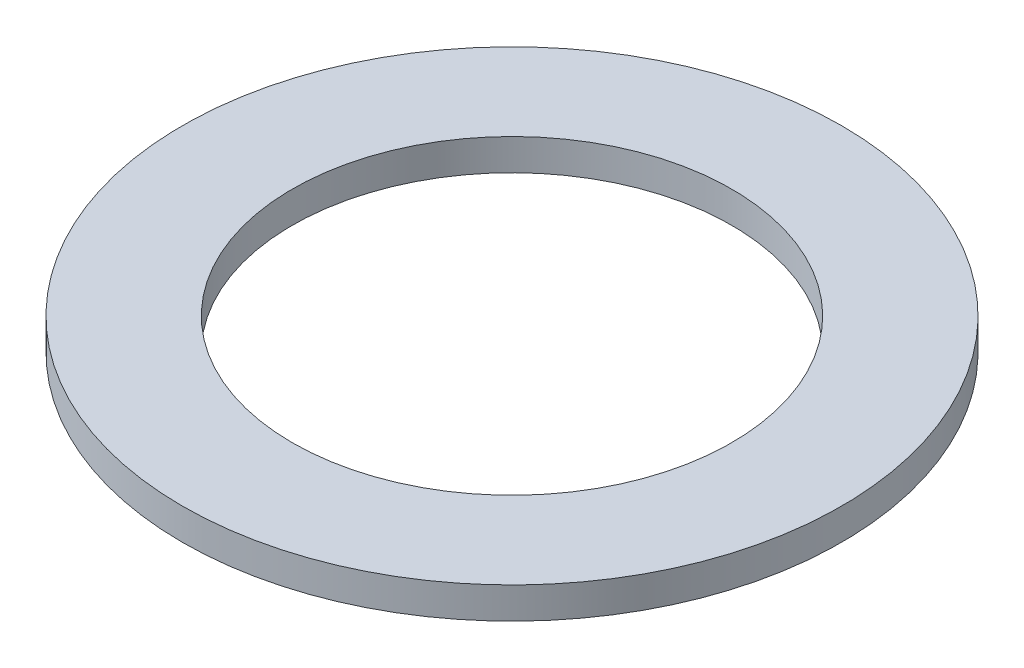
from build123d import *

# Parameters (mm, degrees)
ESQUISSE1_W = 3.5
ESQUISSE1_H = 1


with BuildPart() as part:
    # Esquisse1 → Base-R_volution (revolve)
    with BuildSketch(Plane.XY, mode=Mode.PRIVATE) as base_r_volution_sk:
        with Locations((-8.75, 0.5)):
            Rectangle(ESQUISSE1_W, ESQUISSE1_H)
    revolve(base_r_volution_sk.sketch.rotate(Axis((0, 28, 0), (0, -1, 0)), 270), axis=Axis((0, 28, 0), (0, -1, 0)))


solid = part.part
